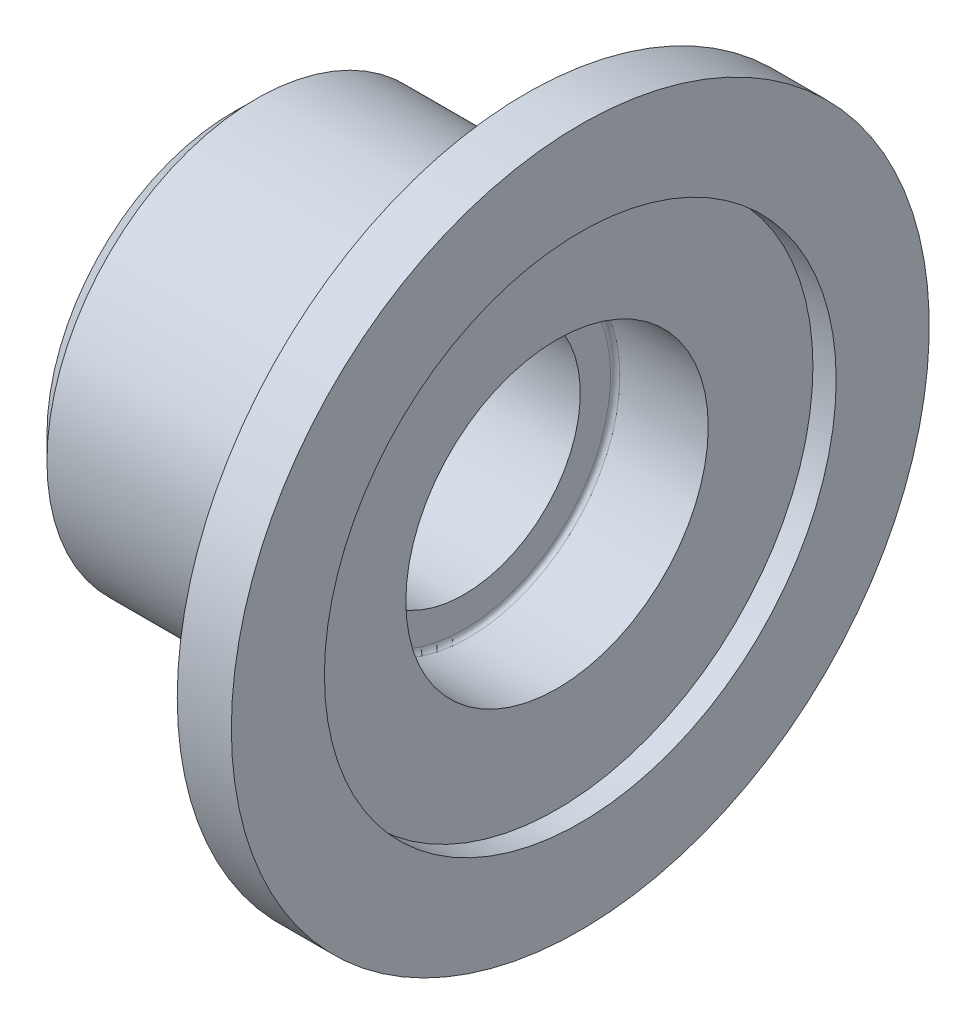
from build123d import *


with BuildPart() as part:
    # Esquisse1 → R_volution1 (revolve)
    with BuildSketch(Plane.XY, mode=Mode.PRIVATE) as r_volution1_sk:
        with BuildLine():
            ThreePointArc((56.084373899, 32.5), (55.377267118, 32.207106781), (55.084373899, 31.5))
            Line((55.084373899, 31.5), (55.084373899, 25))
            Line((55.084373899, 25), (10.454373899, 25))
            Line((10.454373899, 25), (9.454373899, 26))
            Line((9.454373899, 26), (5.454373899, 26))
            Line((5.454373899, 26), (5.454373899, 40))
            Line((5.454373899, 40), (10.454373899, 45))
            Line((10.454373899, 45), (63.454373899, 45))
            ThreePointArc((63.454373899, 45), (66.989907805, 46.464466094), (68.454373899, 50))
            Line((68.454373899, 50), (68.454373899, 75))
            Line((68.454373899, 75), (80.084373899, 75))
            Line((80.084373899, 75), (80.084373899, 55))
            Line((80.084373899, 55), (75.084373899, 55))
            Line((75.084373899, 55), (75.084373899, 32.5))
            Line((75.084373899, 32.5), (56.084373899, 32.5))
        make_face()
    revolve(r_volution1_sk.sketch.rotate(Axis((0, 0, 0), (1, 0, 0)), 90), axis=Axis((0, 0, 0), (1, 0, 0)))


solid = part.part
